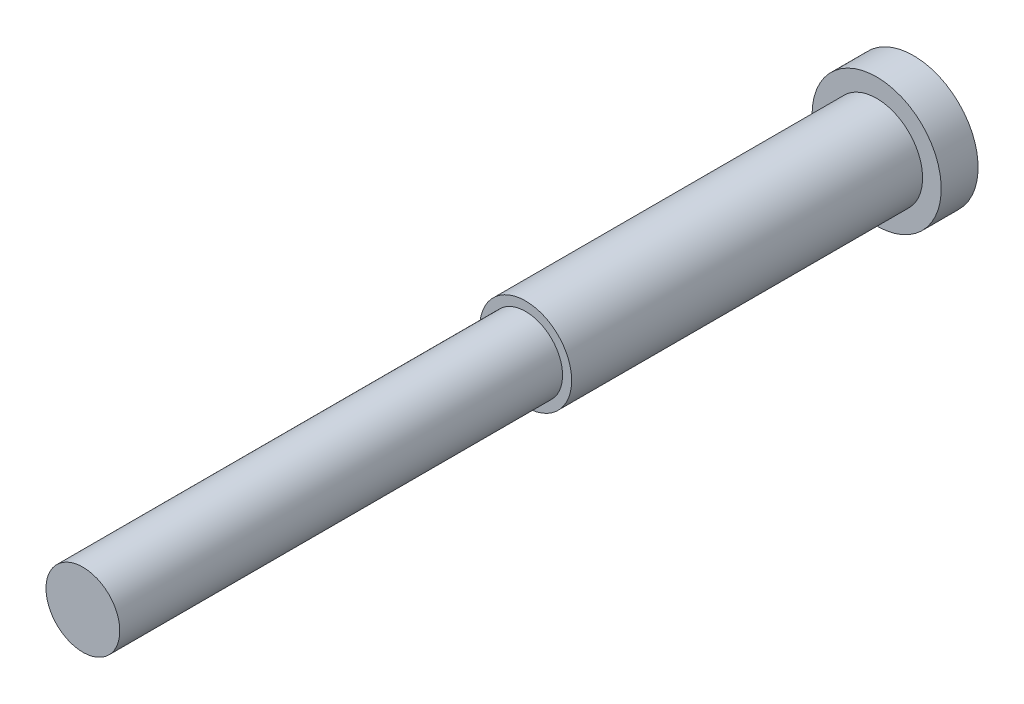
from build123d import *

# Parameters (mm, degrees)
SKETCH1_R           = 7.9121
BASE_EXTRUDE_DEPTH  = 60.4012
SKETCH2_R           = 6.35
BOSS_EXTRUDE1_DEPTH = 76.2
SKETCH3_R           = 11.1125
BOSS_EXTRUDE2_DEPTH = 6.35


with BuildPart() as part:
    # Sketch1 → Base-Extrude (new body)
    with BuildSketch(Plane.XY):
        Circle(SKETCH1_R)
    extrude(amount=BASE_EXTRUDE_DEPTH)

    # Sketch2 → Boss-Extrude1 (add)
    with BuildSketch(Plane.XY.offset(60.4012)):
        with Locations(Location((0, 0, 0), (0, 0, 180))):
            Circle(SKETCH2_R)
    extrude(amount=BOSS_EXTRUDE1_DEPTH)

    # Sketch3 → Boss-Extrude2 (add)
    with BuildSketch(Plane(origin=(0, 0, 0), x_dir=(-1, 0, 0), z_dir=(0, 0, -1))):
        Circle(SKETCH3_R)
    extrude(amount=BOSS_EXTRUDE2_DEPTH)


solid = part.part
